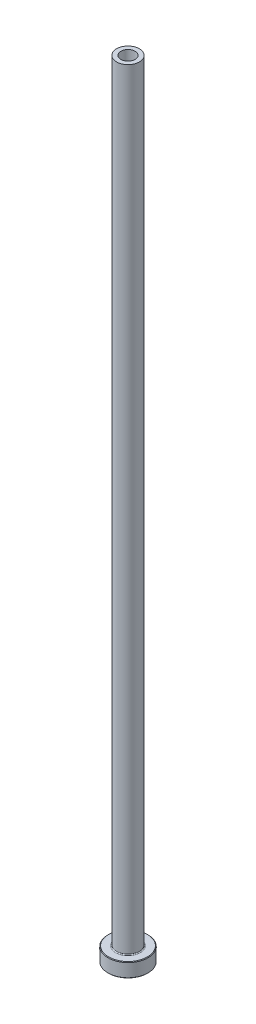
from build123d import *

# Parameters (mm, degrees)
FILLET1_R     = 0.3
CHAMFER1_SIZE = 0.2
CHAMFER3_SIZE = 0.5


with BuildPart() as part:
    # Sketch1 → Revolve1 (revolve)
    with BuildSketch(Plane.XY, mode=Mode.PRIVATE) as revolve1_sk:
        Polygon((-2.5, 275), (-4, 275), (-4, 5), (-7, 5), (-7, 0), (-2.75, 0), (-2.75, 218), (-2.5, 230), align=None)
    revolve(revolve1_sk.sketch.rotate(Axis((0, 92.187680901, 0), (0, -1, 0)), 270), axis=Axis((0, 92.187680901, 0), (0, -1, 0)))

    # Fillet1
    fillet1_edges = [part.edges().sort_by_distance(p)[0] for p in [
        (0, 5, -4),
    ]]
    fillet(fillet1_edges, radius=FILLET1_R)

    # Chamfer1
    chamfer1_edges = [part.edges().sort_by_distance(p)[0] for p in [
        (0, 0, -7),
        (0, 5, -7),
    ]]
    chamfer(chamfer1_edges, length=CHAMFER1_SIZE)

    # Chamfer3
    chamfer3_edges = [part.edges().sort_by_distance(p)[0] for p in [
        (0, 0, -2.75),
    ]]
    chamfer(chamfer3_edges, length=CHAMFER3_SIZE)


solid = part.part
